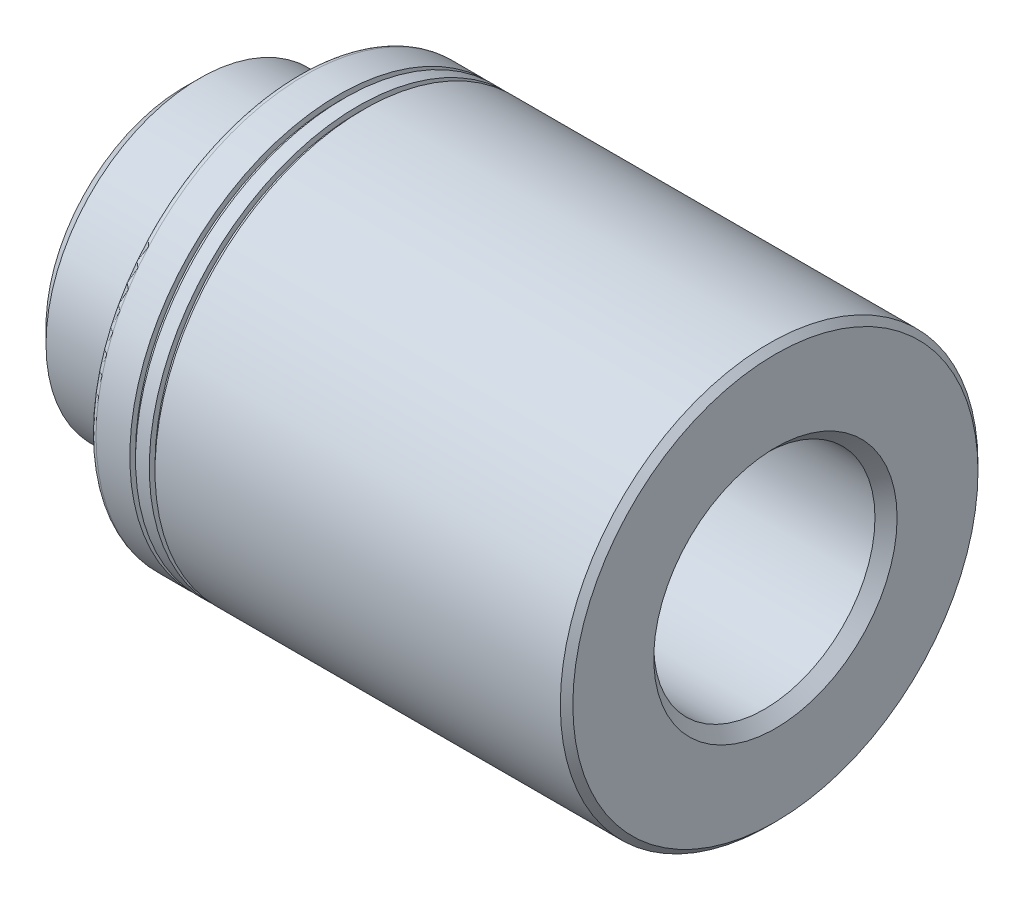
ISO-10303-21;
HEADER;
FILE_DESCRIPTION(('STEP AP214'),'2;1');
FILE_NAME('part.step','',(''),(''),'','','');
FILE_SCHEMA(('AUTOMOTIVE_DESIGN { 1 0 10303 214 1 1 1 1 }'));
ENDSEC;
DATA;
#1=APPLICATION_CONTEXT('core data for automotive mechanical design processes');
#2=APPLICATION_PROTOCOL_DEFINITION('international standard','automotive_design',2000,#1);
#3=PRODUCT_CONTEXT('',#1,'mechanical');
#4=PRODUCT('Part','Part','',(#3));
#5=PRODUCT_RELATED_PRODUCT_CATEGORY('part','',(#4));
#6=PRODUCT_DEFINITION_FORMATION('','',#4);
#7=PRODUCT_DEFINITION_CONTEXT('part definition',#1,'design');
#8=PRODUCT_DEFINITION('design','',#6,#7);
#9=PRODUCT_DEFINITION_SHAPE('','',#8);
#10=(LENGTH_UNIT() NAMED_UNIT(*) SI_UNIT(.MILLI.,.METRE.));
#11=(NAMED_UNIT(*) PLANE_ANGLE_UNIT() SI_UNIT($,.RADIAN.));
#12=(NAMED_UNIT(*) SI_UNIT($,.STERADIAN.) SOLID_ANGLE_UNIT());
#13=UNCERTAINTY_MEASURE_WITH_UNIT(LENGTH_MEASURE(1.E-05),#10,'distance_accuracy_value','');
#14=(GEOMETRIC_REPRESENTATION_CONTEXT(3) GLOBAL_UNCERTAINTY_ASSIGNED_CONTEXT((#13)) GLOBAL_UNIT_ASSIGNED_CONTEXT((#10,
#11,#12)) REPRESENTATION_CONTEXT('',''));
#15=CARTESIAN_POINT('',(0.,0.,0.));
#16=DIRECTION('',(0.,0.,1.));
#17=DIRECTION('',(1.,0.,0.));
#18=AXIS2_PLACEMENT_3D('',#15,#16,#17);
#19=CARTESIAN_POINT('',(2.31648,-2.836926,2.7813));
#20=DIRECTION('',(1.,0.,0.));
#21=DIRECTION('',(0.,0.,-1.));
#22=AXIS2_PLACEMENT_3D('',#19,#20,#21);
#23=PLANE('',#22);
#24=CARTESIAN_POINT('',(2.31648,0.,0.));
#25=DIRECTION('',(1.,0.,0.));
#26=DIRECTION('',(0.,0.,-1.));
#27=AXIS2_PLACEMENT_3D('',#24,#25,#26);
#28=CIRCLE('',#27,2.7051);
#29=CARTESIAN_POINT('',(2.31648,0.,-2.7051));
#30=VERTEX_POINT('',#29);
#31=EDGE_CURVE('E18',#30,#30,#28,.T.);
#32=ORIENTED_EDGE('',*,*,#31,.F.);
#33=EDGE_LOOP('',(#32));
#34=FACE_BOUND('',#33,.T.);
#35=CARTESIAN_POINT('',(2.31648,0.,0.));
#36=DIRECTION('',(1.,0.,0.));
#37=DIRECTION('',(0.,0.,-1.));
#38=AXIS2_PLACEMENT_3D('',#35,#36,#37);
#39=CIRCLE('',#38,2.7813);
#40=CARTESIAN_POINT('',(2.31648,0.,-2.7813));
#41=VERTEX_POINT('',#40);
#42=EDGE_CURVE('E67',#41,#41,#39,.F.);
#43=ORIENTED_EDGE('',*,*,#42,.F.);
#44=EDGE_LOOP('',(#43));
#45=FACE_BOUND('',#44,.T.);
#46=ADVANCED_FACE('F14',(#34,#45),#23,.T.);
#47=CARTESIAN_POINT('',(2.31648,0.,0.));
#48=DIRECTION('',(1.,0.,0.));
#49=DIRECTION('',(0.,0.,-1.));
#50=AXIS2_PLACEMENT_3D('',#47,#48,#49);
#51=CYLINDRICAL_SURFACE('',#50,2.7051);
#52=ORIENTED_EDGE('',*,*,#31,.T.);
#53=EDGE_LOOP('',(#52));
#54=FACE_BOUND('',#53,.T.);
#55=CARTESIAN_POINT('',(2.39268,0.,0.));
#56=DIRECTION('',(1.,0.,0.));
#57=DIRECTION('',(0.,0.,-1.));
#58=AXIS2_PLACEMENT_3D('',#55,#56,#57);
#59=CIRCLE('',#58,2.7051);
#60=CARTESIAN_POINT('',(2.39268,0.,-2.7051));
#61=VERTEX_POINT('',#60);
#62=EDGE_CURVE('E65',#61,#61,#59,.T.);
#63=ORIENTED_EDGE('',*,*,#62,.F.);
#64=EDGE_LOOP('',(#63));
#65=FACE_BOUND('',#64,.T.);
#66=ADVANCED_FACE('F74',(#54,#65),#51,.T.);
#67=CARTESIAN_POINT('',(2.1336,0.,0.));
#68=DIRECTION('',(1.,0.,0.));
#69=DIRECTION('',(0.,0.,-1.));
#70=AXIS2_PLACEMENT_3D('',#67,#68,#69);
#71=CYLINDRICAL_SURFACE('',#70,2.7813);
#72=CARTESIAN_POINT('',(2.1336,0.,0.));
#73=DIRECTION('',(1.,0.,0.));
#74=DIRECTION('',(0.,0.,-1.));
#75=AXIS2_PLACEMENT_3D('',#72,#73,#74);
#76=CIRCLE('',#75,2.7813);
#77=CARTESIAN_POINT('',(2.1336,0.,-2.7813));
#78=VERTEX_POINT('',#77);
#79=EDGE_CURVE('E62',#78,#78,#76,.F.);
#80=ORIENTED_EDGE('',*,*,#79,.F.);
#81=EDGE_LOOP('',(#80));
#82=FACE_BOUND('',#81,.T.);
#83=ORIENTED_EDGE('',*,*,#42,.T.);
#84=EDGE_LOOP('',(#83));
#85=FACE_BOUND('',#84,.T.);
#86=ADVANCED_FACE('F84',(#82,#85),#71,.T.);
#87=CARTESIAN_POINT('',(2.39268,-2.836926,-2.7813));
#88=DIRECTION('',(-1.,0.,0.));
#89=DIRECTION('',(0.,0.,1.));
#90=AXIS2_PLACEMENT_3D('',#87,#88,#89);
#91=PLANE('',#90);
#92=CARTESIAN_POINT('',(2.39268,0.,0.));
#93=DIRECTION('',(1.,0.,0.));
#94=DIRECTION('',(0.,0.,-1.));
#95=AXIS2_PLACEMENT_3D('',#92,#93,#94);
#96=CIRCLE('',#95,2.7813);
#97=CARTESIAN_POINT('',(2.39268,0.,-2.7813));
#98=VERTEX_POINT('',#97);
#99=EDGE_CURVE('E59',#98,#98,#96,.T.);
#100=ORIENTED_EDGE('',*,*,#99,.F.);
#101=EDGE_LOOP('',(#100));
#102=FACE_BOUND('',#101,.T.);
#103=ORIENTED_EDGE('',*,*,#62,.T.);
#104=EDGE_LOOP('',(#103));
#105=FACE_BOUND('',#104,.T.);
#106=ADVANCED_FACE('F151',(#102,#105),#91,.T.);
#107=CARTESIAN_POINT('',(2.1336,-2.836926,-2.7813));
#108=DIRECTION('',(-1.,0.,0.));
#109=DIRECTION('',(0.,0.,1.));
#110=AXIS2_PLACEMENT_3D('',#107,#108,#109);
#111=PLANE('',#110);
#112=ORIENTED_EDGE('',*,*,#79,.T.);
#113=EDGE_LOOP('',(#112));
#114=FACE_BOUND('',#113,.T.);
#115=CARTESIAN_POINT('',(2.1336,0.,0.));
#116=DIRECTION('',(1.,0.,0.));
#117=DIRECTION('',(0.,0.,-1.));
#118=AXIS2_PLACEMENT_3D('',#115,#116,#117);
#119=CIRCLE('',#118,2.7051);
#120=CARTESIAN_POINT('',(2.1336,0.,-2.7051));
#121=VERTEX_POINT('',#120);
#122=EDGE_CURVE('E56',#121,#121,#119,.F.);
#123=ORIENTED_EDGE('',*,*,#122,.F.);
#124=EDGE_LOOP('',(#123));
#125=FACE_BOUND('',#124,.T.);
#126=ADVANCED_FACE('F147',(#114,#125),#111,.T.);
#127=CARTESIAN_POINT('',(2.39268,0.,0.));
#128=DIRECTION('',(1.,0.,0.));
#129=DIRECTION('',(0.,0.,-1.));
#130=AXIS2_PLACEMENT_3D('',#127,#128,#129);
#131=CYLINDRICAL_SURFACE('',#130,2.7813);
#132=ORIENTED_EDGE('',*,*,#99,.T.);
#133=EDGE_LOOP('',(#132));
#134=FACE_BOUND('',#133,.T.);
#135=CARTESIAN_POINT('',(7.790561,0.,0.));
#136=DIRECTION('',(1.,0.,0.));
#137=DIRECTION('',(0.,0.,-1.));
#138=AXIS2_PLACEMENT_3D('',#135,#136,#137);
#139=CIRCLE('',#138,2.7813);
#140=CARTESIAN_POINT('',(7.790561,0.,-2.7813));
#141=VERTEX_POINT('',#140);
#142=EDGE_CURVE('E31',#141,#141,#139,.T.);
#143=ORIENTED_EDGE('',*,*,#142,.F.);
#144=EDGE_LOOP('',(#143));
#145=FACE_BOUND('',#144,.T.);
#146=ADVANCED_FACE('F143',(#134,#145),#131,.T.);
#147=CARTESIAN_POINT('',(2.0574,0.,0.));
#148=DIRECTION('',(1.,0.,0.));
#149=DIRECTION('',(0.,0.,-1.));
#150=AXIS2_PLACEMENT_3D('',#147,#148,#149);
#151=CYLINDRICAL_SURFACE('',#150,2.7051);
#152=CARTESIAN_POINT('',(2.0574,0.,0.));
#153=DIRECTION('',(1.,0.,0.));
#154=DIRECTION('',(0.,0.,-1.));
#155=AXIS2_PLACEMENT_3D('',#152,#153,#154);
#156=CIRCLE('',#155,2.7051);
#157=CARTESIAN_POINT('',(2.0574,0.,-2.7051));
#158=VERTEX_POINT('',#157);
#159=EDGE_CURVE('E53',#158,#158,#156,.F.);
#160=ORIENTED_EDGE('',*,*,#159,.F.);
#161=EDGE_LOOP('',(#160));
#162=FACE_BOUND('',#161,.T.);
#163=ORIENTED_EDGE('',*,*,#122,.T.);
#164=EDGE_LOOP('',(#163));
#165=FACE_BOUND('',#164,.T.);
#166=ADVANCED_FACE('F139',(#162,#165),#151,.T.);
#167=CARTESIAN_POINT('',(7.790561,0.,0.));
#168=DIRECTION('',(-1.,0.,0.));
#169=DIRECTION('',(0.,0.,1.));
#170=AXIS2_PLACEMENT_3D('',#167,#168,#169);
#171=CONICAL_SURFACE('',#170,2.7813,0.785398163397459);
#172=ORIENTED_EDGE('',*,*,#142,.T.);
#173=EDGE_LOOP('',(#172));
#174=FACE_BOUND('',#173,.T.);
#175=CARTESIAN_POINT('',(7.874,0.,0.));
#176=DIRECTION('',(-1.,0.,0.));
#177=DIRECTION('',(0.,0.,1.));
#178=AXIS2_PLACEMENT_3D('',#175,#176,#177);
#179=CIRCLE('',#178,2.697861);
#180=CARTESIAN_POINT('',(7.874,0.,2.697861));
#181=VERTEX_POINT('',#180);
#182=EDGE_CURVE('E50',#181,#181,#179,.F.);
#183=ORIENTED_EDGE('',*,*,#182,.F.);
#184=EDGE_LOOP('',(#183));
#185=FACE_BOUND('',#184,.T.);
#186=ADVANCED_FACE('F135',(#174,#185),#171,.T.);
#187=CARTESIAN_POINT('',(2.0574,-2.836926,2.7813));
#188=DIRECTION('',(1.,0.,0.));
#189=DIRECTION('',(0.,0.,-1.));
#190=AXIS2_PLACEMENT_3D('',#187,#188,#189);
#191=PLANE('',#190);
#192=ORIENTED_EDGE('',*,*,#159,.T.);
#193=EDGE_LOOP('',(#192));
#194=FACE_BOUND('',#193,.T.);
#195=CARTESIAN_POINT('',(2.0574,0.,0.));
#196=DIRECTION('',(1.,0.,0.));
#197=DIRECTION('',(0.,0.,-1.));
#198=AXIS2_PLACEMENT_3D('',#195,#196,#197);
#199=CIRCLE('',#198,2.7813);
#200=CARTESIAN_POINT('',(2.0574,0.,-2.7813));
#201=VERTEX_POINT('',#200);
#202=EDGE_CURVE('E47',#201,#201,#199,.F.);
#203=ORIENTED_EDGE('',*,*,#202,.F.);
#204=EDGE_LOOP('',(#203));
#205=FACE_BOUND('',#204,.T.);
#206=ADVANCED_FACE('F131',(#194,#205),#191,.T.);
#207=CARTESIAN_POINT('',(7.874,-2.75181822,2.697861));
#208=DIRECTION('',(1.,0.,0.));
#209=DIRECTION('',(0.,0.,-1.));
#210=AXIS2_PLACEMENT_3D('',#207,#208,#209);
#211=PLANE('',#210);
#212=ORIENTED_EDGE('',*,*,#182,.T.);
#213=EDGE_LOOP('',(#212));
#214=FACE_BOUND('',#213,.T.);
#215=CARTESIAN_POINT('',(7.874,0.,0.));
#216=DIRECTION('',(1.,0.,0.));
#217=DIRECTION('',(0.,0.,-1.));
#218=AXIS2_PLACEMENT_3D('',#215,#216,#217);
#219=CIRCLE('',#218,1.62052);
#220=CARTESIAN_POINT('',(7.874,0.,-1.62052));
#221=VERTEX_POINT('',#220);
#222=EDGE_CURVE('E43',#221,#221,#219,.T.);
#223=ORIENTED_EDGE('',*,*,#222,.F.);
#224=EDGE_LOOP('',(#223));
#225=FACE_BOUND('',#224,.T.);
#226=ADVANCED_FACE('F127',(#214,#225),#211,.T.);
#227=CARTESIAN_POINT('',(1.607439,0.,0.));
#228=DIRECTION('',(1.,0.,0.));
#229=DIRECTION('',(0.,0.,-1.));
#230=AXIS2_PLACEMENT_3D('',#227,#228,#229);
#231=CYLINDRICAL_SURFACE('',#230,2.7813);
#232=CARTESIAN_POINT('',(1.607439,0.,0.));
#233=DIRECTION('',(-1.,0.,0.));
#234=DIRECTION('',(0.,0.,1.));
#235=AXIS2_PLACEMENT_3D('',#232,#233,#234);
#236=CIRCLE('',#235,2.7813);
#237=CARTESIAN_POINT('',(1.607439,0.,2.7813));
#238=VERTEX_POINT('',#237);
#239=EDGE_CURVE('E46',#238,#238,#236,.T.);
#240=ORIENTED_EDGE('',*,*,#239,.F.);
#241=EDGE_LOOP('',(#240));
#242=FACE_BOUND('',#241,.T.);
#243=ORIENTED_EDGE('',*,*,#202,.T.);
#244=EDGE_LOOP('',(#243));
#245=FACE_BOUND('',#244,.T.);
#246=ADVANCED_FACE('F123',(#242,#245),#231,.T.);
#247=CARTESIAN_POINT('',(7.874,0.,0.));
#248=DIRECTION('',(1.,0.,0.));
#249=DIRECTION('',(0.,0.,-1.));
#250=AXIS2_PLACEMENT_3D('',#247,#248,#249);
#251=CONICAL_SURFACE('',#250,1.62052,0.785398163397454);
#252=CARTESIAN_POINT('',(7.72668,0.,0.));
#253=DIRECTION('',(1.,0.,0.));
#254=DIRECTION('',(0.,0.,-1.));
#255=AXIS2_PLACEMENT_3D('',#252,#253,#254);
#256=CIRCLE('',#255,1.4732);
#257=CARTESIAN_POINT('',(7.72668,0.,-1.4732));
#258=VERTEX_POINT('',#257);
#259=EDGE_CURVE('E42',#258,#258,#256,.T.);
#260=ORIENTED_EDGE('',*,*,#259,.F.);
#261=EDGE_LOOP('',(#260));
#262=FACE_BOUND('',#261,.T.);
#263=ORIENTED_EDGE('',*,*,#222,.T.);
#264=EDGE_LOOP('',(#263));
#265=FACE_BOUND('',#264,.T.);
#266=ADVANCED_FACE('F119',(#262,#265),#251,.F.);
#267=CARTESIAN_POINT('',(1.607439,0.,0.));
#268=DIRECTION('',(1.,0.,0.));
#269=DIRECTION('',(0.,0.,-1.));
#270=AXIS2_PLACEMENT_3D('',#267,#268,#269);
#271=TOROIDAL_SURFACE('',#270,2.697861,0.0834390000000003);
#272=ORIENTED_EDGE('',*,*,#239,.T.);
#273=EDGE_LOOP('',(#272));
#274=FACE_BOUND('',#273,.T.);
#275=CARTESIAN_POINT('',(1.524,0.,0.));
#276=DIRECTION('',(1.,0.,0.));
#277=DIRECTION('',(0.,0.,-1.));
#278=AXIS2_PLACEMENT_3D('',#275,#276,#277);
#279=CIRCLE('',#278,2.697861);
#280=CARTESIAN_POINT('',(1.524,0.,-2.697861));
#281=VERTEX_POINT('',#280);
#282=EDGE_CURVE('E39',#281,#281,#279,.F.);
#283=ORIENTED_EDGE('',*,*,#282,.F.);
#284=EDGE_LOOP('',(#283));
#285=FACE_BOUND('',#284,.T.);
#286=ADVANCED_FACE('F113',(#274,#285),#271,.T.);
#287=CARTESIAN_POINT('',(7.72668,0.,0.));
#288=DIRECTION('',(-1.,0.,0.));
#289=DIRECTION('',(0.,0.,1.));
#290=AXIS2_PLACEMENT_3D('',#287,#288,#289);
#291=CYLINDRICAL_SURFACE('',#290,1.4732);
#292=CARTESIAN_POINT('',(0.14732,0.,0.));
#293=DIRECTION('',(1.,0.,0.));
#294=DIRECTION('',(0.,0.,-1.));
#295=AXIS2_PLACEMENT_3D('',#292,#293,#294);
#296=CIRCLE('',#295,1.4732);
#297=CARTESIAN_POINT('',(0.14732,0.,-1.4732));
#298=VERTEX_POINT('',#297);
#299=EDGE_CURVE('E38',#298,#298,#296,.T.);
#300=ORIENTED_EDGE('',*,*,#299,.F.);
#301=EDGE_LOOP('',(#300));
#302=FACE_BOUND('',#301,.T.);
#303=ORIENTED_EDGE('',*,*,#259,.T.);
#304=EDGE_LOOP('',(#303));
#305=FACE_BOUND('',#304,.T.);
#306=ADVANCED_FACE('F104',(#302,#305),#291,.F.);
#307=CARTESIAN_POINT('',(1.524,-2.75181822,-2.697861));
#308=DIRECTION('',(-1.,0.,0.));
#309=DIRECTION('',(0.,0.,1.));
#310=AXIS2_PLACEMENT_3D('',#307,#308,#309);
#311=PLANE('',#310);
#312=ORIENTED_EDGE('',*,*,#282,.T.);
#313=EDGE_LOOP('',(#312));
#314=FACE_BOUND('',#313,.T.);
#315=CARTESIAN_POINT('',(1.524,0.,0.));
#316=DIRECTION('',(1.,0.,0.));
#317=DIRECTION('',(0.,0.,-1.));
#318=AXIS2_PLACEMENT_3D('',#315,#316,#317);
#319=CIRCLE('',#318,2.0447);
#320=CARTESIAN_POINT('',(1.524,0.,-2.0447));
#321=VERTEX_POINT('',#320);
#322=EDGE_CURVE('E35',#321,#321,#319,.F.);
#323=ORIENTED_EDGE('',*,*,#322,.F.);
#324=EDGE_LOOP('',(#323));
#325=FACE_BOUND('',#324,.T.);
#326=ADVANCED_FACE('F102',(#314,#325),#311,.T.);
#327=CARTESIAN_POINT('',(0.14732,0.,0.));
#328=DIRECTION('',(-1.,0.,0.));
#329=DIRECTION('',(0.,0.,1.));
#330=AXIS2_PLACEMENT_3D('',#327,#328,#329);
#331=CONICAL_SURFACE('',#330,1.4732,0.785398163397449);
#332=CARTESIAN_POINT('',(0.,0.,0.));
#333=DIRECTION('',(-1.,0.,0.));
#334=DIRECTION('',(0.,0.,1.));
#335=AXIS2_PLACEMENT_3D('',#332,#333,#334);
#336=CIRCLE('',#335,1.62052);
#337=CARTESIAN_POINT('',(0.,0.,1.62052));
#338=VERTEX_POINT('',#337);
#339=EDGE_CURVE('E27',#338,#338,#336,.F.);
#340=ORIENTED_EDGE('',*,*,#339,.F.);
#341=EDGE_LOOP('',(#340));
#342=FACE_BOUND('',#341,.T.);
#343=ORIENTED_EDGE('',*,*,#299,.T.);
#344=EDGE_LOOP('',(#343));
#345=FACE_BOUND('',#344,.T.);
#346=ADVANCED_FACE('F98',(#342,#345),#331,.F.);
#347=CARTESIAN_POINT('',(0.20447,0.,0.));
#348=DIRECTION('',(1.,0.,0.));
#349=DIRECTION('',(0.,0.,-1.));
#350=AXIS2_PLACEMENT_3D('',#347,#348,#349);
#351=CYLINDRICAL_SURFACE('',#350,2.0447);
#352=CARTESIAN_POINT('',(0.20447,0.,0.));
#353=DIRECTION('',(-1.,0.,0.));
#354=DIRECTION('',(0.,0.,1.));
#355=AXIS2_PLACEMENT_3D('',#352,#353,#354);
#356=CIRCLE('',#355,2.0447);
#357=CARTESIAN_POINT('',(0.20447,0.,2.0447));
#358=VERTEX_POINT('',#357);
#359=EDGE_CURVE('E22',#358,#358,#356,.T.);
#360=ORIENTED_EDGE('',*,*,#359,.F.);
#361=EDGE_LOOP('',(#360));
#362=FACE_BOUND('',#361,.T.);
#363=ORIENTED_EDGE('',*,*,#322,.T.);
#364=EDGE_LOOP('',(#363));
#365=FACE_BOUND('',#364,.T.);
#366=ADVANCED_FACE('F91',(#362,#365),#351,.T.);
#367=CARTESIAN_POINT('',(0.,-1.8770346,-1.84023));
#368=DIRECTION('',(-1.,0.,0.));
#369=DIRECTION('',(0.,0.,1.));
#370=AXIS2_PLACEMENT_3D('',#367,#368,#369);
#371=PLANE('',#370);
#372=CARTESIAN_POINT('',(0.,0.,0.));
#373=DIRECTION('',(1.,0.,0.));
#374=DIRECTION('',(0.,0.,-1.));
#375=AXIS2_PLACEMENT_3D('',#372,#373,#374);
#376=CIRCLE('',#375,1.84023);
#377=CARTESIAN_POINT('',(0.,0.,-1.84023));
#378=VERTEX_POINT('',#377);
#379=EDGE_CURVE('E10',#378,#378,#376,.T.);
#380=ORIENTED_EDGE('',*,*,#379,.F.);
#381=EDGE_LOOP('',(#380));
#382=FACE_BOUND('',#381,.T.);
#383=ORIENTED_EDGE('',*,*,#339,.T.);
#384=EDGE_LOOP('',(#383));
#385=FACE_BOUND('',#384,.T.);
#386=ADVANCED_FACE('F87',(#382,#385),#371,.T.);
#387=CARTESIAN_POINT('',(0.,0.,0.));
#388=DIRECTION('',(1.,0.,0.));
#389=DIRECTION('',(0.,0.,-1.));
#390=AXIS2_PLACEMENT_3D('',#387,#388,#389);
#391=CONICAL_SURFACE('',#390,1.84023,0.785398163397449);
#392=ORIENTED_EDGE('',*,*,#379,.T.);
#393=EDGE_LOOP('',(#392));
#394=FACE_BOUND('',#393,.T.);
#395=ORIENTED_EDGE('',*,*,#359,.T.);
#396=EDGE_LOOP('',(#395));
#397=FACE_BOUND('',#396,.T.);
#398=ADVANCED_FACE('F16',(#394,#397),#391,.T.);
#399=CLOSED_SHELL('',(#46,#66,#86,#106,#126,#146,#166,#186,#206,#226,#246,#266,#286,#306,#326,
#346,#366,#386,#398));
#400=MANIFOLD_SOLID_BREP('B1',#399);
#401=ADVANCED_BREP_SHAPE_REPRESENTATION('',(#18,#400),#14);
#402=SHAPE_DEFINITION_REPRESENTATION(#9,#401);
ENDSEC;
END-ISO-10303-21;
